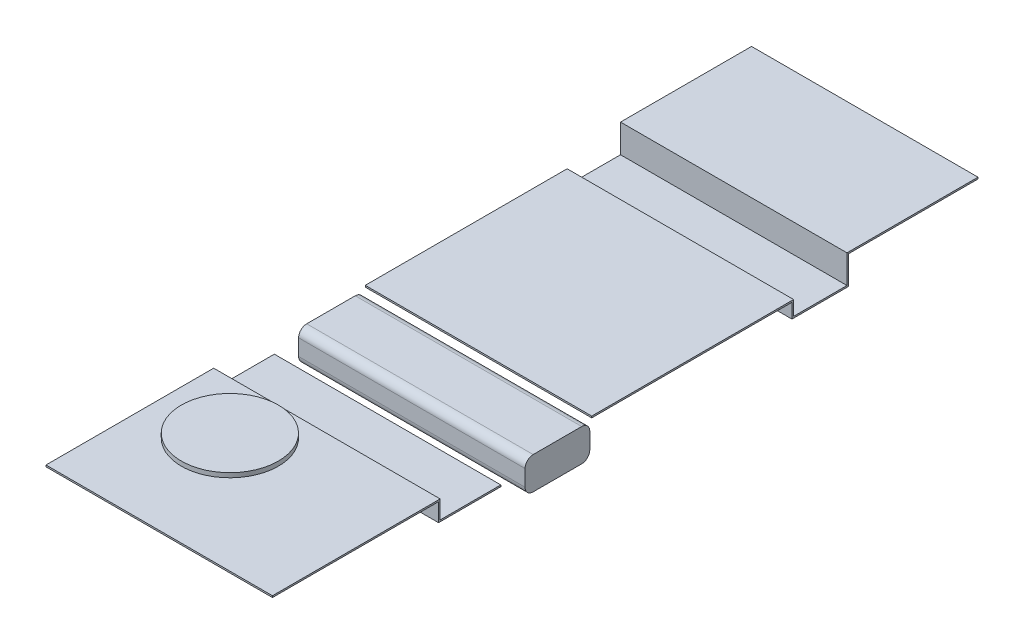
from build123d import *

# Parameters (mm, degrees)
CROSS_START           = 50.8
SKETCH1_W             = 101.6
SKETCH1_H             = 50.8
CROSS_MEMBER_DEPTH    = 355.6
FILLET1_R             = 12.7
EXTRUDE_THIN1_START   = 50.8
EXTRUDE_THIN1_DEPTH   = 355.6
EXTRUDE_THIN1_2_DEPTH = 355.6
SKETCH3_R             = 76.2
BOSS_EXTRUDE1_DEPTH   = 9.525


with BuildPart() as part:
    # Sketch1 → cross member (new body)
    with BuildSketch(Plane(origin=(0, 0, 0), x_dir=(0, 0, -1), z_dir=(1, 0, 0)).offset(CROSS_START)):
        with Locations((558.8, 177.8)):
            Rectangle(SKETCH1_W, SKETCH1_H)
    extrude(amount=-CROSS_MEMBER_DEPTH)

    # Fillet1
    fillet1_edges = [part.edges().sort_by_distance(p)[0] for p in [
        (-127, 203.2, -508),
        (-127, 203.2, -609.6),
        (-127, 152.4, -609.6),
        (-127, 152.4, -508),
    ]]
    fillet(fillet1_edges, radius=FILLET1_R)


with BuildPart() as body_2:
    # Sketch2 → Extrude-Thin1 (new body)
    with BuildSketch(Plane(origin=(0, 0, 0), x_dir=(0, 0, -1), z_dir=(1, 0, 0)).offset(EXTRUDE_THIN1_START)):
        Polygon((612.668806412, 207.01), (927.1, 207.01), (927.1, 184.15), (1016, 184.15), (1016, 228.6), (1219.2, 228.6), (1219.2, 231.14), (1013.46, 231.14), (1013.46, 186.69), (929.64, 186.69), (929.64, 209.55), (612.668806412, 209.55), align=None)
    extrude(amount=-EXTRUDE_THIN1_DEPTH)


with BuildPart() as body_3:
    # Sketch2 → Extrude-Thin1 2 (new body)
    with BuildSketch(Plane(origin=(0, 0, 0), x_dir=(0, 0, -1), z_dir=(1, 0, 0)).offset(EXTRUDE_THIN1_START)):
        Polygon((469.9, 187.325), (374.65, 187.325), (374.65, 215.9), (111.341361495, 215.9), (111.341361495, 213.36), (372.11, 213.36), (372.11, 184.785), (469.9, 184.785), align=None)
    extrude(amount=-EXTRUDE_THIN1_2_DEPTH)

    # Sketch3 → Boss-Extrude1 (add)
    with BuildSketch(Plane(origin=(0, 213.36, 0), x_dir=(1, 0, 0), z_dir=(0, 1, 0))):
        with Locations(Location((-196.85, 292.1, 0), (0, 0, 90))):
            Circle(SKETCH3_R)
    extrude(amount=BOSS_EXTRUDE1_DEPTH)


solid = Compound([part.part, body_2.part, body_3.part])
